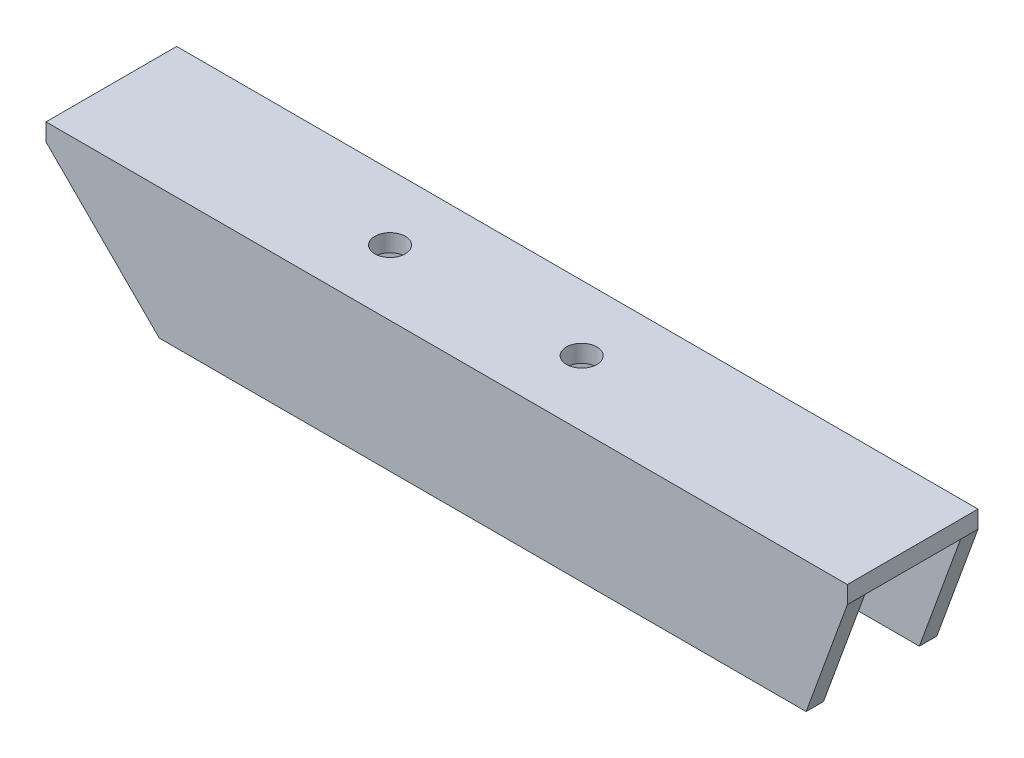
ISO-10303-21;
HEADER;
FILE_DESCRIPTION(('STEP AP214'),'2;1');
FILE_NAME('part.step','',(''),(''),'','','');
FILE_SCHEMA(('AUTOMOTIVE_DESIGN { 1 0 10303 214 1 1 1 1 }'));
ENDSEC;
DATA;
#1=APPLICATION_CONTEXT('core data for automotive mechanical design processes');
#2=APPLICATION_PROTOCOL_DEFINITION('international standard','automotive_design',2000,#1);
#3=PRODUCT_CONTEXT('',#1,'mechanical');
#4=PRODUCT('Part','Part','',(#3));
#5=PRODUCT_RELATED_PRODUCT_CATEGORY('part','',(#4));
#6=PRODUCT_DEFINITION_FORMATION('','',#4);
#7=PRODUCT_DEFINITION_CONTEXT('part definition',#1,'design');
#8=PRODUCT_DEFINITION('design','',#6,#7);
#9=PRODUCT_DEFINITION_SHAPE('','',#8);
#10=(LENGTH_UNIT() NAMED_UNIT(*) SI_UNIT(.MILLI.,.METRE.));
#11=(NAMED_UNIT(*) PLANE_ANGLE_UNIT() SI_UNIT($,.RADIAN.));
#12=(NAMED_UNIT(*) SI_UNIT($,.STERADIAN.) SOLID_ANGLE_UNIT());
#13=UNCERTAINTY_MEASURE_WITH_UNIT(LENGTH_MEASURE(1.E-05),#10,'distance_accuracy_value','');
#14=(GEOMETRIC_REPRESENTATION_CONTEXT(3) GLOBAL_UNCERTAINTY_ASSIGNED_CONTEXT((#13)) GLOBAL_UNIT_ASSIGNED_CONTEXT((#10,
#11,#12)) REPRESENTATION_CONTEXT('',''));
#15=CARTESIAN_POINT('',(0.,0.,0.));
#16=DIRECTION('',(0.,0.,1.));
#17=DIRECTION('',(1.,0.,0.));
#18=AXIS2_PLACEMENT_3D('',#15,#16,#17);
#19=CARTESIAN_POINT('',(92.,0.,-2.));
#20=DIRECTION('',(0.,1.,0.));
#21=DIRECTION('',(0.,0.,1.));
#22=AXIS2_PLACEMENT_3D('',#19,#20,#21);
#23=PLANE('',#22);
#24=DIRECTION('',(-1.,0.,0.));
#25=VECTOR('',#24,1.);
#26=CARTESIAN_POINT('',(92.,0.,-2.));
#27=LINE('',#26,#25);
#28=CARTESIAN_POINT('',(87.2683869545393,0.,-2.));
#29=VERTEX_POINT('',#28);
#30=CARTESIAN_POINT('',(13.0000000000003,0.,-2.));
#31=VERTEX_POINT('',#30);
#32=EDGE_CURVE('E124',#29,#31,#27,.T.);
#33=ORIENTED_EDGE('',*,*,#32,.F.);
#34=DIRECTION('',(0.,0.,1.));
#35=VECTOR('',#34,1.);
#36=CARTESIAN_POINT('',(87.2683869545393,0.,-92.));
#37=LINE('',#36,#35);
#38=CARTESIAN_POINT('',(87.2683869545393,0.,0.));
#39=VERTEX_POINT('',#38);
#40=EDGE_CURVE('E112',#29,#39,#37,.T.);
#41=ORIENTED_EDGE('',*,*,#40,.T.);
#42=DIRECTION('',(-1.,0.,0.));
#43=VECTOR('',#42,1.);
#44=CARTESIAN_POINT('',(92.,0.,0.));
#45=LINE('',#44,#43);
#46=CARTESIAN_POINT('',(13.0000000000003,0.,0.));
#47=VERTEX_POINT('',#46);
#48=EDGE_CURVE('E123',#39,#47,#45,.T.);
#49=ORIENTED_EDGE('',*,*,#48,.T.);
#50=DIRECTION('',(0.,0.,1.));
#51=VECTOR('',#50,1.);
#52=CARTESIAN_POINT('',(13.0000000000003,0.,-92.));
#53=LINE('',#52,#51);
#54=EDGE_CURVE('E210',#31,#47,#53,.T.);
#55=ORIENTED_EDGE('',*,*,#54,.F.);
#56=EDGE_LOOP('',(#33,#41,#49,#55));
#57=FACE_BOUND('',#56,.T.);
#58=ADVANCED_FACE('F33',(#57),#23,.F.);
#59=CARTESIAN_POINT('',(92.,13.,-2.));
#60=DIRECTION('',(0.,0.,1.));
#61=DIRECTION('',(0.,-1.,0.));
#62=AXIS2_PLACEMENT_3D('',#59,#60,#61);
#63=PLANE('',#62);
#64=DIRECTION('',(-1.,0.,0.));
#65=VECTOR('',#64,1.);
#66=CARTESIAN_POINT('',(92.,13.,-2.));
#67=LINE('',#66,#65);
#68=CARTESIAN_POINT('',(92.,13.,-2.));
#69=VERTEX_POINT('',#68);
#70=CARTESIAN_POINT('',(0.,13.,-2.));
#71=VERTEX_POINT('',#70);
#72=EDGE_CURVE('E150',#69,#71,#67,.T.);
#73=ORIENTED_EDGE('',*,*,#72,.F.);
#74=DIRECTION('',(-0.342020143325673,-0.939692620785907,0.));
#75=VECTOR('',#74,1.);
#76=CARTESIAN_POINT('',(92.,13.,-2.));
#77=LINE('',#76,#75);
#78=EDGE_CURVE('E204',#69,#29,#77,.T.);
#79=ORIENTED_EDGE('',*,*,#78,.T.);
#80=ORIENTED_EDGE('',*,*,#32,.T.);
#81=DIRECTION('',(-0.707106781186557,0.707106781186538,0.));
#82=VECTOR('',#81,1.);
#83=CARTESIAN_POINT('',(46.0000000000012,-33.,-2.));
#84=LINE('',#83,#82);
#85=EDGE_CURVE('E184',#31,#71,#84,.T.);
#86=ORIENTED_EDGE('',*,*,#85,.T.);
#87=EDGE_LOOP('',(#73,#79,#80,#86));
#88=FACE_BOUND('',#87,.T.);
#89=ADVANCED_FACE('F216',(#88),#63,.F.);
#90=CARTESIAN_POINT('',(92.,13.,-13.));
#91=DIRECTION('',(0.,1.,0.));
#92=DIRECTION('',(0.,0.,1.));
#93=AXIS2_PLACEMENT_3D('',#90,#91,#92);
#94=PLANE('',#93);
#95=CARTESIAN_POINT('',(54.,13.,-7.5));
#96=DIRECTION('',(0.,1.,0.));
#97=DIRECTION('',(0.,0.,1.));
#98=AXIS2_PLACEMENT_3D('',#95,#96,#97);
#99=CIRCLE('',#98,1.75);
#100=CARTESIAN_POINT('',(54.,13.,-5.75));
#101=VERTEX_POINT('',#100);
#102=EDGE_CURVE('E329',#101,#101,#99,.T.);
#103=ORIENTED_EDGE('',*,*,#102,.T.);
#104=EDGE_LOOP('',(#103));
#105=FACE_BOUND('',#104,.T.);
#106=CARTESIAN_POINT('',(32.,13.,-7.5));
#107=DIRECTION('',(0.,1.,0.));
#108=DIRECTION('',(0.,0.,1.));
#109=AXIS2_PLACEMENT_3D('',#106,#107,#108);
#110=CIRCLE('',#109,1.75);
#111=CARTESIAN_POINT('',(32.,13.,-5.75));
#112=VERTEX_POINT('',#111);
#113=EDGE_CURVE('E118',#112,#112,#110,.T.);
#114=ORIENTED_EDGE('',*,*,#113,.T.);
#115=EDGE_LOOP('',(#114));
#116=FACE_BOUND('',#115,.T.);
#117=DIRECTION('',(0.,0.,-1.));
#118=VECTOR('',#117,1.);
#119=CARTESIAN_POINT('',(0.,13.,-13.));
#120=LINE('',#119,#118);
#121=CARTESIAN_POINT('',(0.,13.,-13.));
#122=VERTEX_POINT('',#121);
#123=EDGE_CURVE('E180',#71,#122,#120,.T.);
#124=ORIENTED_EDGE('',*,*,#123,.T.);
#125=DIRECTION('',(-1.,0.,0.));
#126=VECTOR('',#125,1.);
#127=CARTESIAN_POINT('',(92.,13.,-13.));
#128=LINE('',#127,#126);
#129=CARTESIAN_POINT('',(92.,13.,-13.));
#130=VERTEX_POINT('',#129);
#131=EDGE_CURVE('E147',#130,#122,#128,.T.);
#132=ORIENTED_EDGE('',*,*,#131,.F.);
#133=DIRECTION('',(0.,0.,-1.));
#134=VECTOR('',#133,1.);
#135=CARTESIAN_POINT('',(92.,13.,-13.));
#136=LINE('',#135,#134);
#137=EDGE_CURVE('E168',#69,#130,#136,.T.);
#138=ORIENTED_EDGE('',*,*,#137,.F.);
#139=ORIENTED_EDGE('',*,*,#72,.T.);
#140=EDGE_LOOP('',(#124,#132,#138,#139));
#141=FACE_BOUND('',#140,.T.);
#142=ADVANCED_FACE('F195',(#105,#116,#141),#94,.F.);
#143=CARTESIAN_POINT('',(92.,0.,-13.));
#144=DIRECTION('',(0.,0.,-1.));
#145=DIRECTION('',(0.,1.,0.));
#146=AXIS2_PLACEMENT_3D('',#143,#144,#145);
#147=PLANE('',#146);
#148=DIRECTION('',(-1.,0.,0.));
#149=VECTOR('',#148,1.);
#150=CARTESIAN_POINT('',(92.,0.,-13.));
#151=LINE('',#150,#149);
#152=CARTESIAN_POINT('',(87.2683869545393,0.,-13.));
#153=VERTEX_POINT('',#152);
#154=CARTESIAN_POINT('',(13.0000000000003,0.,-13.));
#155=VERTEX_POINT('',#154);
#156=EDGE_CURVE('E145',#153,#155,#151,.T.);
#157=ORIENTED_EDGE('',*,*,#156,.F.);
#158=DIRECTION('',(0.342020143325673,0.939692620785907,0.));
#159=VECTOR('',#158,1.);
#160=CARTESIAN_POINT('',(87.8218805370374,1.52071111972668,-13.));
#161=LINE('',#160,#159);
#162=EDGE_CURVE('E202',#153,#130,#161,.T.);
#163=ORIENTED_EDGE('',*,*,#162,.T.);
#164=ORIENTED_EDGE('',*,*,#131,.T.);
#165=DIRECTION('',(0.707106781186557,-0.707106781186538,0.));
#166=VECTOR('',#165,1.);
#167=CARTESIAN_POINT('',(52.5000000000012,-39.4999999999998,-13.));
#168=LINE('',#167,#166);
#169=EDGE_CURVE('E201',#122,#155,#168,.T.);
#170=ORIENTED_EDGE('',*,*,#169,.T.);
#171=EDGE_LOOP('',(#157,#163,#164,#170));
#172=FACE_BOUND('',#171,.T.);
#173=ADVANCED_FACE('F200',(#172),#147,.F.);
#174=CARTESIAN_POINT('',(92.,0.,-15.));
#175=DIRECTION('',(0.,1.,0.));
#176=DIRECTION('',(0.,0.,1.));
#177=AXIS2_PLACEMENT_3D('',#174,#175,#176);
#178=PLANE('',#177);
#179=DIRECTION('',(-1.,0.,0.));
#180=VECTOR('',#179,1.);
#181=CARTESIAN_POINT('',(92.,0.,-15.));
#182=LINE('',#181,#180);
#183=CARTESIAN_POINT('',(87.2683869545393,0.,-15.));
#184=VERTEX_POINT('',#183);
#185=CARTESIAN_POINT('',(13.0000000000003,0.,-15.));
#186=VERTEX_POINT('',#185);
#187=EDGE_CURVE('E143',#184,#186,#182,.T.);
#188=ORIENTED_EDGE('',*,*,#187,.F.);
#189=EDGE_CURVE('E125',#184,#153,#37,.T.);
#190=ORIENTED_EDGE('',*,*,#189,.T.);
#191=ORIENTED_EDGE('',*,*,#156,.T.);
#192=EDGE_CURVE('E212',#186,#155,#53,.T.);
#193=ORIENTED_EDGE('',*,*,#192,.F.);
#194=EDGE_LOOP('',(#188,#190,#191,#193));
#195=FACE_BOUND('',#194,.T.);
#196=ADVANCED_FACE('F240',(#195),#178,.F.);
#197=CARTESIAN_POINT('',(92.,15.,-15.));
#198=DIRECTION('',(0.,0.,1.));
#199=DIRECTION('',(0.,-1.,0.));
#200=AXIS2_PLACEMENT_3D('',#197,#198,#199);
#201=PLANE('',#200);
#202=DIRECTION('',(0.,1.,0.));
#203=VECTOR('',#202,1.);
#204=CARTESIAN_POINT('',(92.,15.,-15.));
#205=LINE('',#204,#203);
#206=CARTESIAN_POINT('',(92.,13.,-15.));
#207=VERTEX_POINT('',#206);
#208=CARTESIAN_POINT('',(92.,15.,-15.));
#209=VERTEX_POINT('',#208);
#210=EDGE_CURVE('E165',#207,#209,#205,.T.);
#211=ORIENTED_EDGE('',*,*,#210,.F.);
#212=DIRECTION('',(-0.342020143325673,-0.939692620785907,0.));
#213=VECTOR('',#212,1.);
#214=CARTESIAN_POINT('',(92.6427876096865,14.766044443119,-15.));
#215=LINE('',#214,#213);
#216=EDGE_CURVE('E47',#207,#184,#215,.T.);
#217=ORIENTED_EDGE('',*,*,#216,.T.);
#218=ORIENTED_EDGE('',*,*,#187,.T.);
#219=DIRECTION('',(-0.707106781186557,0.707106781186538,0.));
#220=VECTOR('',#219,1.);
#221=CARTESIAN_POINT('',(45.0000000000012,-32.,-15.));
#222=LINE('',#221,#220);
#223=CARTESIAN_POINT('',(0.,13.,-15.));
#224=VERTEX_POINT('',#223);
#225=EDGE_CURVE('E213',#186,#224,#222,.T.);
#226=ORIENTED_EDGE('',*,*,#225,.T.);
#227=DIRECTION('',(0.,1.,0.));
#228=VECTOR('',#227,1.);
#229=CARTESIAN_POINT('',(0.,15.,-15.));
#230=LINE('',#229,#228);
#231=CARTESIAN_POINT('',(0.,15.,-15.));
#232=VERTEX_POINT('',#231);
#233=EDGE_CURVE('E183',#224,#232,#230,.T.);
#234=ORIENTED_EDGE('',*,*,#233,.T.);
#235=DIRECTION('',(-1.,0.,0.));
#236=VECTOR('',#235,1.);
#237=CARTESIAN_POINT('',(92.,15.,-15.));
#238=LINE('',#237,#236);
#239=EDGE_CURVE('E133',#209,#232,#238,.T.);
#240=ORIENTED_EDGE('',*,*,#239,.F.);
#241=EDGE_LOOP('',(#211,#217,#218,#226,#234,#240));
#242=FACE_BOUND('',#241,.T.);
#243=ADVANCED_FACE('F172',(#242),#201,.F.);
#244=CARTESIAN_POINT('',(92.,15.,0.));
#245=DIRECTION('',(0.,-1.,0.));
#246=DIRECTION('',(0.,0.,-1.));
#247=AXIS2_PLACEMENT_3D('',#244,#245,#246);
#248=PLANE('',#247);
#249=CARTESIAN_POINT('',(54.,15.,-7.5));
#250=DIRECTION('',(0.,1.,0.));
#251=DIRECTION('',(0.,0.,1.));
#252=AXIS2_PLACEMENT_3D('',#249,#250,#251);
#253=CIRCLE('',#252,1.75);
#254=CARTESIAN_POINT('',(54.,15.,-5.75));
#255=VERTEX_POINT('',#254);
#256=EDGE_CURVE('E326',#255,#255,#253,.T.);
#257=ORIENTED_EDGE('',*,*,#256,.F.);
#258=EDGE_LOOP('',(#257));
#259=FACE_BOUND('',#258,.T.);
#260=CARTESIAN_POINT('',(32.,15.,-7.5));
#261=DIRECTION('',(0.,1.,0.));
#262=DIRECTION('',(0.,0.,1.));
#263=AXIS2_PLACEMENT_3D('',#260,#261,#262);
#264=CIRCLE('',#263,1.75);
#265=CARTESIAN_POINT('',(32.,15.,-5.75));
#266=VERTEX_POINT('',#265);
#267=EDGE_CURVE('E330',#266,#266,#264,.T.);
#268=ORIENTED_EDGE('',*,*,#267,.F.);
#269=EDGE_LOOP('',(#268));
#270=FACE_BOUND('',#269,.T.);
#271=DIRECTION('',(0.,0.,1.));
#272=VECTOR('',#271,1.);
#273=CARTESIAN_POINT('',(0.,15.,0.));
#274=LINE('',#273,#272);
#275=CARTESIAN_POINT('',(0.,15.,0.));
#276=VERTEX_POINT('',#275);
#277=EDGE_CURVE('E185',#232,#276,#274,.T.);
#278=ORIENTED_EDGE('',*,*,#277,.T.);
#279=DIRECTION('',(-1.,0.,0.));
#280=VECTOR('',#279,1.);
#281=CARTESIAN_POINT('',(92.,15.,0.));
#282=LINE('',#281,#280);
#283=CARTESIAN_POINT('',(92.,15.,0.));
#284=VERTEX_POINT('',#283);
#285=EDGE_CURVE('E129',#284,#276,#282,.T.);
#286=ORIENTED_EDGE('',*,*,#285,.F.);
#287=DIRECTION('',(0.,0.,1.));
#288=VECTOR('',#287,1.);
#289=CARTESIAN_POINT('',(92.,15.,0.));
#290=LINE('',#289,#288);
#291=EDGE_CURVE('E135',#209,#284,#290,.T.);
#292=ORIENTED_EDGE('',*,*,#291,.F.);
#293=ORIENTED_EDGE('',*,*,#239,.T.);
#294=EDGE_LOOP('',(#278,#286,#292,#293));
#295=FACE_BOUND('',#294,.T.);
#296=ADVANCED_FACE('F246',(#259,#270,#295),#248,.F.);
#297=CARTESIAN_POINT('',(92.,0.,0.));
#298=DIRECTION('',(0.,0.,-1.));
#299=DIRECTION('',(-1.,0.,0.));
#300=AXIS2_PLACEMENT_3D('',#297,#298,#299);
#301=PLANE('',#300);
#302=ORIENTED_EDGE('',*,*,#48,.F.);
#303=DIRECTION('',(-0.342020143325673,-0.939692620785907,0.));
#304=VECTOR('',#303,1.);
#305=CARTESIAN_POINT('',(87.2683869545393,0.,0.));
#306=LINE('',#305,#304);
#307=CARTESIAN_POINT('',(92.,13.,0.));
#308=VERTEX_POINT('',#307);
#309=EDGE_CURVE('E109',#308,#39,#306,.T.);
#310=ORIENTED_EDGE('',*,*,#309,.F.);
#311=DIRECTION('',(0.,-1.,0.));
#312=VECTOR('',#311,1.);
#313=CARTESIAN_POINT('',(92.,0.,0.));
#314=LINE('',#313,#312);
#315=EDGE_CURVE('E130',#284,#308,#314,.T.);
#316=ORIENTED_EDGE('',*,*,#315,.F.);
#317=ORIENTED_EDGE('',*,*,#285,.T.);
#318=DIRECTION('',(0.,-1.,0.));
#319=VECTOR('',#318,1.);
#320=CARTESIAN_POINT('',(0.,0.,0.));
#321=LINE('',#320,#319);
#322=CARTESIAN_POINT('',(0.,13.,0.));
#323=VERTEX_POINT('',#322);
#324=EDGE_CURVE('E138',#276,#323,#321,.T.);
#325=ORIENTED_EDGE('',*,*,#324,.T.);
#326=DIRECTION('',(-0.707106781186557,0.707106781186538,0.));
#327=VECTOR('',#326,1.);
#328=CARTESIAN_POINT('',(0.,13.,0.));
#329=LINE('',#328,#327);
#330=EDGE_CURVE('E55',#47,#323,#329,.T.);
#331=ORIENTED_EDGE('',*,*,#330,.F.);
#332=EDGE_LOOP('',(#302,#310,#316,#317,#325,#331));
#333=FACE_BOUND('',#332,.T.);
#334=ADVANCED_FACE('F127',(#333),#301,.F.);
#335=CARTESIAN_POINT('',(92.,0.,0.));
#336=DIRECTION('',(-1.,0.,0.));
#337=DIRECTION('',(0.,0.,1.));
#338=AXIS2_PLACEMENT_3D('',#335,#336,#337);
#339=PLANE('',#338);
#340=ORIENTED_EDGE('',*,*,#315,.T.);
#341=DIRECTION('',(0.,0.,-1.));
#342=VECTOR('',#341,1.);
#343=CARTESIAN_POINT('',(92.,13.,0.));
#344=LINE('',#343,#342);
#345=EDGE_CURVE('E11',#308,#69,#344,.T.);
#346=ORIENTED_EDGE('',*,*,#345,.T.);
#347=ORIENTED_EDGE('',*,*,#137,.T.);
#348=EDGE_CURVE('E36',#130,#207,#344,.T.);
#349=ORIENTED_EDGE('',*,*,#348,.T.);
#350=ORIENTED_EDGE('',*,*,#210,.T.);
#351=ORIENTED_EDGE('',*,*,#291,.T.);
#352=EDGE_LOOP('',(#340,#346,#347,#349,#350,#351));
#353=FACE_BOUND('',#352,.T.);
#354=ADVANCED_FACE('F164',(#353),#339,.F.);
#355=CARTESIAN_POINT('',(0.,0.,0.));
#356=DIRECTION('',(-1.,0.,0.));
#357=DIRECTION('',(0.,0.,1.));
#358=AXIS2_PLACEMENT_3D('',#355,#356,#357);
#359=PLANE('',#358);
#360=DIRECTION('',(0.,0.,-1.));
#361=VECTOR('',#360,1.);
#362=CARTESIAN_POINT('',(0.,13.,0.));
#363=LINE('',#362,#361);
#364=EDGE_CURVE('E154',#323,#71,#363,.T.);
#365=ORIENTED_EDGE('',*,*,#364,.F.);
#366=ORIENTED_EDGE('',*,*,#324,.F.);
#367=ORIENTED_EDGE('',*,*,#277,.F.);
#368=ORIENTED_EDGE('',*,*,#233,.F.);
#369=EDGE_CURVE('E153',#122,#224,#363,.T.);
#370=ORIENTED_EDGE('',*,*,#369,.F.);
#371=ORIENTED_EDGE('',*,*,#123,.F.);
#372=EDGE_LOOP('',(#365,#366,#367,#368,#370,#371));
#373=FACE_BOUND('',#372,.T.);
#374=ADVANCED_FACE('F191',(#373),#359,.T.);
#375=CARTESIAN_POINT('',(0.,13.,-92.));
#376=DIRECTION('',(0.707106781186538,0.707106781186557,0.));
#377=DIRECTION('',(-0.707106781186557,0.707106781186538,0.));
#378=AXIS2_PLACEMENT_3D('',#375,#376,#377);
#379=PLANE('',#378);
#380=ORIENTED_EDGE('',*,*,#369,.T.);
#381=ORIENTED_EDGE('',*,*,#225,.F.);
#382=ORIENTED_EDGE('',*,*,#192,.T.);
#383=ORIENTED_EDGE('',*,*,#169,.F.);
#384=EDGE_LOOP('',(#380,#381,#382,#383));
#385=FACE_BOUND('',#384,.T.);
#386=ADVANCED_FACE('F220',(#385),#379,.F.);
#387=ORIENTED_EDGE('',*,*,#54,.T.);
#388=ORIENTED_EDGE('',*,*,#330,.T.);
#389=ORIENTED_EDGE('',*,*,#364,.T.);
#390=ORIENTED_EDGE('',*,*,#85,.F.);
#391=EDGE_LOOP('',(#387,#388,#389,#390));
#392=FACE_BOUND('',#391,.T.);
#393=ADVANCED_FACE('F217',(#392),#379,.F.);
#394=CARTESIAN_POINT('',(87.2683869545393,0.,-92.));
#395=DIRECTION('',(-0.939692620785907,0.342020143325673,0.));
#396=DIRECTION('',(-0.342020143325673,-0.939692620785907,0.));
#397=AXIS2_PLACEMENT_3D('',#394,#395,#396);
#398=PLANE('',#397);
#399=ORIENTED_EDGE('',*,*,#189,.F.);
#400=ORIENTED_EDGE('',*,*,#216,.F.);
#401=ORIENTED_EDGE('',*,*,#348,.F.);
#402=ORIENTED_EDGE('',*,*,#162,.F.);
#403=EDGE_LOOP('',(#399,#400,#401,#402));
#404=FACE_BOUND('',#403,.T.);
#405=ADVANCED_FACE('F219',(#404),#398,.F.);
#406=ORIENTED_EDGE('',*,*,#345,.F.);
#407=ORIENTED_EDGE('',*,*,#309,.T.);
#408=ORIENTED_EDGE('',*,*,#40,.F.);
#409=ORIENTED_EDGE('',*,*,#78,.F.);
#410=EDGE_LOOP('',(#406,#407,#408,#409));
#411=FACE_BOUND('',#410,.T.);
#412=ADVANCED_FACE('F111',(#411),#398,.F.);
#413=CARTESIAN_POINT('',(32.,-77.,-7.5));
#414=DIRECTION('',(0.,1.,0.));
#415=DIRECTION('',(0.,0.,1.));
#416=AXIS2_PLACEMENT_3D('',#413,#414,#415);
#417=CYLINDRICAL_SURFACE('',#416,1.75);
#418=ORIENTED_EDGE('',*,*,#267,.T.);
#419=EDGE_LOOP('',(#418));
#420=FACE_BOUND('',#419,.T.);
#421=ORIENTED_EDGE('',*,*,#113,.F.);
#422=EDGE_LOOP('',(#421));
#423=FACE_BOUND('',#422,.T.);
#424=ADVANCED_FACE('F285',(#420,#423),#417,.F.);
#425=CARTESIAN_POINT('',(54.,-77.,-7.5));
#426=DIRECTION('',(0.,1.,0.));
#427=DIRECTION('',(0.,0.,1.));
#428=AXIS2_PLACEMENT_3D('',#425,#426,#427);
#429=CYLINDRICAL_SURFACE('',#428,1.75);
#430=ORIENTED_EDGE('',*,*,#256,.T.);
#431=EDGE_LOOP('',(#430));
#432=FACE_BOUND('',#431,.T.);
#433=ORIENTED_EDGE('',*,*,#102,.F.);
#434=EDGE_LOOP('',(#433));
#435=FACE_BOUND('',#434,.T.);
#436=ADVANCED_FACE('F309',(#432,#435),#429,.F.);
#437=CLOSED_SHELL('',(#58,#89,#142,#173,#196,#243,#296,#334,#354,#374,#386,#393,#405,#412,#424,#436));
#438=MANIFOLD_SOLID_BREP('B2',#437);
#439=ADVANCED_BREP_SHAPE_REPRESENTATION('',(#18,#438),#14);
#440=SHAPE_DEFINITION_REPRESENTATION(#9,#439);
ENDSEC;
END-ISO-10303-21;
